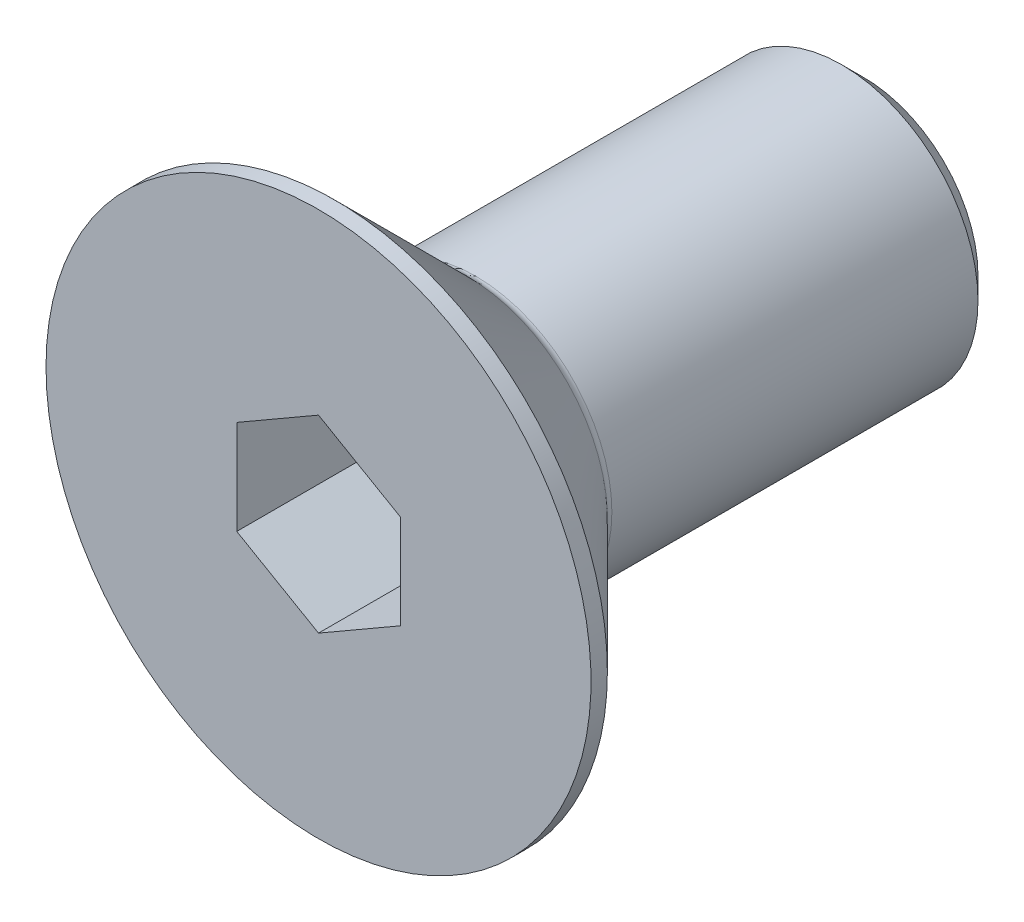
ISO-10303-21;
HEADER;
FILE_DESCRIPTION(('STEP AP214'),'2;1');
FILE_NAME('part.step','',(''),(''),'','','');
FILE_SCHEMA(('AUTOMOTIVE_DESIGN { 1 0 10303 214 1 1 1 1 }'));
ENDSEC;
DATA;
#1=APPLICATION_CONTEXT('core data for automotive mechanical design processes');
#2=APPLICATION_PROTOCOL_DEFINITION('international standard','automotive_design',2000,#1);
#3=PRODUCT_CONTEXT('',#1,'mechanical');
#4=PRODUCT('Part','Part','',(#3));
#5=PRODUCT_RELATED_PRODUCT_CATEGORY('part','',(#4));
#6=PRODUCT_DEFINITION_FORMATION('','',#4);
#7=PRODUCT_DEFINITION_CONTEXT('part definition',#1,'design');
#8=PRODUCT_DEFINITION('design','',#6,#7);
#9=PRODUCT_DEFINITION_SHAPE('','',#8);
#10=(LENGTH_UNIT() NAMED_UNIT(*) SI_UNIT(.MILLI.,.METRE.));
#11=(NAMED_UNIT(*) PLANE_ANGLE_UNIT() SI_UNIT($,.RADIAN.));
#12=(NAMED_UNIT(*) SI_UNIT($,.STERADIAN.) SOLID_ANGLE_UNIT());
#13=UNCERTAINTY_MEASURE_WITH_UNIT(LENGTH_MEASURE(1.E-05),#10,'distance_accuracy_value','');
#14=(GEOMETRIC_REPRESENTATION_CONTEXT(3) GLOBAL_UNCERTAINTY_ASSIGNED_CONTEXT((#13)) GLOBAL_UNIT_ASSIGNED_CONTEXT((#10,
#11,#12)) REPRESENTATION_CONTEXT('',''));
#15=CARTESIAN_POINT('',(0.,0.,0.));
#16=DIRECTION('',(0.,0.,1.));
#17=DIRECTION('',(1.,0.,0.));
#18=AXIS2_PLACEMENT_3D('',#15,#16,#17);
#19=CARTESIAN_POINT('',(0.,1.73205080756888,0.));
#20=DIRECTION('',(-0.5,0.866025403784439,0.));
#21=DIRECTION('',(-0.866025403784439,-0.5,0.));
#22=AXIS2_PLACEMENT_3D('',#19,#20,#21);
#23=PLANE('',#22);
#24=DIRECTION('',(0.,0.,1.));
#25=VECTOR('',#24,1.);
#26=CARTESIAN_POINT('',(0.,1.73205080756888,0.));
#27=LINE('',#26,#25);
#28=CARTESIAN_POINT('',(0.,1.73205080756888,-2.3));
#29=VERTEX_POINT('',#28);
#30=CARTESIAN_POINT('',(0.,1.73205080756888,0.));
#31=VERTEX_POINT('',#30);
#32=EDGE_CURVE('E82',#29,#31,#27,.T.);
#33=ORIENTED_EDGE('',*,*,#32,.T.);
#34=DIRECTION('',(-0.866025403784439,-0.5,0.));
#35=VECTOR('',#34,1.);
#36=CARTESIAN_POINT('',(0.,1.73205080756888,0.));
#37=LINE('',#36,#35);
#38=CARTESIAN_POINT('',(-1.5,0.866025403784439,0.));
#39=VERTEX_POINT('',#38);
#40=EDGE_CURVE('E71',#39,#31,#37,.F.);
#41=ORIENTED_EDGE('',*,*,#40,.F.);
#42=DIRECTION('',(0.,0.,1.));
#43=VECTOR('',#42,1.);
#44=CARTESIAN_POINT('',(-1.5,0.866025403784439,0.));
#45=LINE('',#44,#43);
#46=CARTESIAN_POINT('',(-1.5,0.866025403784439,-2.3));
#47=VERTEX_POINT('',#46);
#48=EDGE_CURVE('E138',#39,#47,#45,.F.);
#49=ORIENTED_EDGE('',*,*,#48,.T.);
#50=DIRECTION('',(-0.866025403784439,-0.5,0.));
#51=VECTOR('',#50,1.);
#52=CARTESIAN_POINT('',(0.,1.73205080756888,-2.3));
#53=LINE('',#52,#51);
#54=EDGE_CURVE('E67',#29,#47,#53,.T.);
#55=ORIENTED_EDGE('',*,*,#54,.F.);
#56=EDGE_LOOP('',(#33,#41,#49,#55));
#57=FACE_BOUND('',#56,.T.);
#58=ADVANCED_FACE('F16',(#57),#23,.F.);
#59=CARTESIAN_POINT('',(1.5,0.86602540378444,0.));
#60=DIRECTION('',(0.499999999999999,0.866025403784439,0.));
#61=DIRECTION('',(-0.866025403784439,0.499999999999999,0.));
#62=AXIS2_PLACEMENT_3D('',#59,#60,#61);
#63=PLANE('',#62);
#64=DIRECTION('',(0.,0.,-1.));
#65=VECTOR('',#64,1.);
#66=CARTESIAN_POINT('',(1.5,0.86602540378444,0.));
#67=LINE('',#66,#65);
#68=CARTESIAN_POINT('',(1.5,0.86602540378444,-2.3));
#69=VERTEX_POINT('',#68);
#70=CARTESIAN_POINT('',(1.5,0.86602540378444,0.));
#71=VERTEX_POINT('',#70);
#72=EDGE_CURVE('E87',#69,#71,#67,.F.);
#73=ORIENTED_EDGE('',*,*,#72,.T.);
#74=DIRECTION('',(-0.866025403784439,0.499999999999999,0.));
#75=VECTOR('',#74,1.);
#76=CARTESIAN_POINT('',(1.5,0.86602540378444,0.));
#77=LINE('',#76,#75);
#78=EDGE_CURVE('E75',#31,#71,#77,.F.);
#79=ORIENTED_EDGE('',*,*,#78,.F.);
#80=ORIENTED_EDGE('',*,*,#32,.F.);
#81=DIRECTION('',(-0.866025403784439,0.499999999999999,0.));
#82=VECTOR('',#81,1.);
#83=CARTESIAN_POINT('',(1.5,0.86602540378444,-2.3));
#84=LINE('',#83,#82);
#85=EDGE_CURVE('E88',#69,#29,#84,.T.);
#86=ORIENTED_EDGE('',*,*,#85,.F.);
#87=EDGE_LOOP('',(#73,#79,#80,#86));
#88=FACE_BOUND('',#87,.T.);
#89=ADVANCED_FACE('F85',(#88),#63,.F.);
#90=CARTESIAN_POINT('',(-1.5,0.866025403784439,0.));
#91=DIRECTION('',(-1.,0.,0.));
#92=DIRECTION('',(0.,0.,1.));
#93=AXIS2_PLACEMENT_3D('',#90,#91,#92);
#94=PLANE('',#93);
#95=ORIENTED_EDGE('',*,*,#48,.F.);
#96=DIRECTION('',(0.,1.,0.));
#97=VECTOR('',#96,1.);
#98=CARTESIAN_POINT('',(-1.5,0.866025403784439,0.));
#99=LINE('',#98,#97);
#100=CARTESIAN_POINT('',(-1.5,-0.866025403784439,0.));
#101=VERTEX_POINT('',#100);
#102=EDGE_CURVE('E78',#101,#39,#99,.T.);
#103=ORIENTED_EDGE('',*,*,#102,.F.);
#104=DIRECTION('',(0.,0.,1.));
#105=VECTOR('',#104,1.);
#106=CARTESIAN_POINT('',(-1.5,-0.866025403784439,0.));
#107=LINE('',#106,#105);
#108=CARTESIAN_POINT('',(-1.5,-0.866025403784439,-2.3));
#109=VERTEX_POINT('',#108);
#110=EDGE_CURVE('E129',#101,#109,#107,.F.);
#111=ORIENTED_EDGE('',*,*,#110,.T.);
#112=DIRECTION('',(0.,1.,0.));
#113=VECTOR('',#112,1.);
#114=CARTESIAN_POINT('',(-1.5,0.866025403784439,-2.3));
#115=LINE('',#114,#113);
#116=EDGE_CURVE('E136',#47,#109,#115,.F.);
#117=ORIENTED_EDGE('',*,*,#116,.F.);
#118=EDGE_LOOP('',(#95,#103,#111,#117));
#119=FACE_BOUND('',#118,.T.);
#120=ADVANCED_FACE('F141',(#119),#94,.F.);
#121=CARTESIAN_POINT('',(1.5,-0.866025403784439,0.));
#122=DIRECTION('',(1.,0.,0.));
#123=DIRECTION('',(0.,0.,-1.));
#124=AXIS2_PLACEMENT_3D('',#121,#122,#123);
#125=PLANE('',#124);
#126=DIRECTION('',(0.,0.,1.));
#127=VECTOR('',#126,1.);
#128=CARTESIAN_POINT('',(1.5,-0.866025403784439,0.));
#129=LINE('',#128,#127);
#130=CARTESIAN_POINT('',(1.5,-0.866025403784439,-2.3));
#131=VERTEX_POINT('',#130);
#132=CARTESIAN_POINT('',(1.5,-0.866025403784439,0.));
#133=VERTEX_POINT('',#132);
#134=EDGE_CURVE('E121',#131,#133,#129,.T.);
#135=ORIENTED_EDGE('',*,*,#134,.T.);
#136=DIRECTION('',(0.,1.,0.));
#137=VECTOR('',#136,1.);
#138=CARTESIAN_POINT('',(1.5,-0.866025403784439,0.));
#139=LINE('',#138,#137);
#140=EDGE_CURVE('E35',#71,#133,#139,.F.);
#141=ORIENTED_EDGE('',*,*,#140,.F.);
#142=ORIENTED_EDGE('',*,*,#72,.F.);
#143=DIRECTION('',(0.,1.,0.));
#144=VECTOR('',#143,1.);
#145=CARTESIAN_POINT('',(1.5,0.,-2.3));
#146=LINE('',#145,#144);
#147=EDGE_CURVE('E123',#131,#69,#146,.T.);
#148=ORIENTED_EDGE('',*,*,#147,.F.);
#149=EDGE_LOOP('',(#135,#141,#142,#148));
#150=FACE_BOUND('',#149,.T.);
#151=ADVANCED_FACE('F148',(#150),#125,.F.);
#152=CARTESIAN_POINT('',(-1.5,-0.866025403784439,0.));
#153=DIRECTION('',(-0.499999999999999,-0.866025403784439,0.));
#154=DIRECTION('',(0.866025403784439,-0.499999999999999,0.));
#155=AXIS2_PLACEMENT_3D('',#152,#153,#154);
#156=PLANE('',#155);
#157=ORIENTED_EDGE('',*,*,#110,.F.);
#158=DIRECTION('',(0.866025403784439,-0.499999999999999,0.));
#159=VECTOR('',#158,1.);
#160=CARTESIAN_POINT('',(-1.5,-0.866025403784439,0.));
#161=LINE('',#160,#159);
#162=CARTESIAN_POINT('',(0.,-1.73205080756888,0.));
#163=VERTEX_POINT('',#162);
#164=EDGE_CURVE('E132',#163,#101,#161,.F.);
#165=ORIENTED_EDGE('',*,*,#164,.F.);
#166=DIRECTION('',(0.,0.,1.));
#167=VECTOR('',#166,1.);
#168=CARTESIAN_POINT('',(0.,-1.73205080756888,0.));
#169=LINE('',#168,#167);
#170=CARTESIAN_POINT('',(0.,-1.73205080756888,-2.3));
#171=VERTEX_POINT('',#170);
#172=EDGE_CURVE('E119',#163,#171,#169,.F.);
#173=ORIENTED_EDGE('',*,*,#172,.T.);
#174=DIRECTION('',(0.866025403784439,-0.5,0.));
#175=VECTOR('',#174,1.);
#176=CARTESIAN_POINT('',(-1.5,-0.866025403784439,-2.3));
#177=LINE('',#176,#175);
#178=EDGE_CURVE('E126',#109,#171,#177,.T.);
#179=ORIENTED_EDGE('',*,*,#178,.F.);
#180=EDGE_LOOP('',(#157,#165,#173,#179));
#181=FACE_BOUND('',#180,.T.);
#182=ADVANCED_FACE('F155',(#181),#156,.F.);
#183=CARTESIAN_POINT('',(0.,0.,-2.3));
#184=DIRECTION('',(0.,0.,1.));
#185=DIRECTION('',(1.,0.,0.));
#186=AXIS2_PLACEMENT_3D('',#183,#184,#185);
#187=PLANE('',#186);
#188=ORIENTED_EDGE('',*,*,#54,.T.);
#189=ORIENTED_EDGE('',*,*,#116,.T.);
#190=ORIENTED_EDGE('',*,*,#178,.T.);
#191=DIRECTION('',(0.866025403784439,0.5,0.));
#192=VECTOR('',#191,1.);
#193=CARTESIAN_POINT('',(0.,-1.73205080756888,-2.3));
#194=LINE('',#193,#192);
#195=EDGE_CURVE('E116',#171,#131,#194,.T.);
#196=ORIENTED_EDGE('',*,*,#195,.T.);
#197=ORIENTED_EDGE('',*,*,#147,.T.);
#198=ORIENTED_EDGE('',*,*,#85,.T.);
#199=EDGE_LOOP('',(#188,#189,#190,#196,#197,#198));
#200=FACE_BOUND('',#199,.T.);
#201=ADVANCED_FACE('F145',(#200),#187,.T.);
#202=CARTESIAN_POINT('',(0.,-1.73205080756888,0.));
#203=DIRECTION('',(0.5,-0.866025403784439,0.));
#204=DIRECTION('',(0.866025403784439,0.5,0.));
#205=AXIS2_PLACEMENT_3D('',#202,#203,#204);
#206=PLANE('',#205);
#207=ORIENTED_EDGE('',*,*,#172,.F.);
#208=DIRECTION('',(-0.866025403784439,-0.5,0.));
#209=VECTOR('',#208,1.);
#210=CARTESIAN_POINT('',(1.5,-0.866025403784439,0.));
#211=LINE('',#210,#209);
#212=EDGE_CURVE('E114',#133,#163,#211,.T.);
#213=ORIENTED_EDGE('',*,*,#212,.F.);
#214=ORIENTED_EDGE('',*,*,#134,.F.);
#215=ORIENTED_EDGE('',*,*,#195,.F.);
#216=EDGE_LOOP('',(#207,#213,#214,#215));
#217=FACE_BOUND('',#216,.T.);
#218=ADVANCED_FACE('F153',(#217),#206,.F.);
#219=CARTESIAN_POINT('',(2.5,0.,0.));
#220=DIRECTION('',(0.,0.,1.));
#221=DIRECTION('',(1.,0.,0.));
#222=AXIS2_PLACEMENT_3D('',#219,#220,#221);
#223=PLANE('',#222);
#224=ORIENTED_EDGE('',*,*,#140,.T.);
#225=ORIENTED_EDGE('',*,*,#212,.T.);
#226=ORIENTED_EDGE('',*,*,#164,.T.);
#227=ORIENTED_EDGE('',*,*,#102,.T.);
#228=ORIENTED_EDGE('',*,*,#40,.T.);
#229=ORIENTED_EDGE('',*,*,#78,.T.);
#230=EDGE_LOOP('',(#224,#225,#226,#227,#228,#229));
#231=FACE_BOUND('',#230,.T.);
#232=CARTESIAN_POINT('',(0.,0.,0.));
#233=DIRECTION('',(0.,0.,-1.));
#234=DIRECTION('',(-1.,0.,0.));
#235=AXIS2_PLACEMENT_3D('',#232,#233,#234);
#236=CIRCLE('',#235,5.);
#237=CARTESIAN_POINT('',(-5.,0.,0.));
#238=VERTEX_POINT('',#237);
#239=EDGE_CURVE('E20',#238,#238,#236,.T.);
#240=ORIENTED_EDGE('',*,*,#239,.F.);
#241=EDGE_LOOP('',(#240));
#242=FACE_BOUND('',#241,.T.);
#243=ADVANCED_FACE('F72',(#231,#242),#223,.T.);
#244=CARTESIAN_POINT('',(0.,0.,-0.15));
#245=DIRECTION('',(0.,0.,-1.));
#246=DIRECTION('',(-1.,0.,0.));
#247=AXIS2_PLACEMENT_3D('',#244,#245,#246);
#248=CYLINDRICAL_SURFACE('',#247,5.);
#249=ORIENTED_EDGE('',*,*,#239,.T.);
#250=EDGE_LOOP('',(#249));
#251=FACE_BOUND('',#250,.T.);
#252=CARTESIAN_POINT('',(0.,0.,-0.299999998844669));
#253=DIRECTION('',(0.,0.,1.));
#254=DIRECTION('',(1.,0.,0.));
#255=AXIS2_PLACEMENT_3D('',#252,#253,#254);
#256=CIRCLE('',#255,4.99999999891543);
#257=CARTESIAN_POINT('',(4.99999999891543,0.,-0.299999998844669));
#258=VERTEX_POINT('',#257);
#259=EDGE_CURVE('E101',#258,#258,#256,.F.);
#260=ORIENTED_EDGE('',*,*,#259,.F.);
#261=EDGE_LOOP('',(#260));
#262=FACE_BOUND('',#261,.T.);
#263=ADVANCED_FACE('F183',(#251,#262),#248,.T.);
#264=CARTESIAN_POINT('',(0.,0.,-0.299999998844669));
#265=DIRECTION('',(0.,0.,1.));
#266=DIRECTION('',(1.,0.,0.));
#267=AXIS2_PLACEMENT_3D('',#264,#265,#266);
#268=CONICAL_SURFACE('',#267,4.99999999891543,0.785398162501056);
#269=CARTESIAN_POINT('',(0.,0.,-2.74142135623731));
#270=DIRECTION('',(0.,0.,-1.));
#271=DIRECTION('',(-1.,0.,0.));
#272=AXIS2_PLACEMENT_3D('',#269,#270,#271);
#273=CIRCLE('',#272,2.55857864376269);
#274=CARTESIAN_POINT('',(-2.55857864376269,0.,-2.74142135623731));
#275=VERTEX_POINT('',#274);
#276=EDGE_CURVE('E95',#275,#275,#273,.T.);
#277=ORIENTED_EDGE('',*,*,#276,.F.);
#278=EDGE_LOOP('',(#277));
#279=FACE_BOUND('',#278,.T.);
#280=ORIENTED_EDGE('',*,*,#259,.T.);
#281=EDGE_LOOP('',(#280));
#282=FACE_BOUND('',#281,.T.);
#283=ADVANCED_FACE('F179',(#279,#282),#268,.T.);
#284=CARTESIAN_POINT('',(1.25,0.,-10.));
#285=DIRECTION('',(0.,0.,-1.));
#286=DIRECTION('',(-1.,0.,0.));
#287=AXIS2_PLACEMENT_3D('',#284,#285,#286);
#288=PLANE('',#287);
#289=CARTESIAN_POINT('',(0.,0.,-10.0000000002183));
#290=DIRECTION('',(0.,0.,1.));
#291=DIRECTION('',(1.,0.,0.));
#292=AXIS2_PLACEMENT_3D('',#289,#290,#291);
#293=CIRCLE('',#292,2.10000000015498);
#294=CARTESIAN_POINT('',(2.10000000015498,0.,-10.0000000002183));
#295=VERTEX_POINT('',#294);
#296=EDGE_CURVE('E93',#295,#295,#293,.T.);
#297=ORIENTED_EDGE('',*,*,#296,.F.);
#298=EDGE_LOOP('',(#297));
#299=FACE_BOUND('',#298,.T.);
#300=ADVANCED_FACE('F176',(#299),#288,.T.);
#301=CARTESIAN_POINT('',(0.,0.,-2.88284271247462));
#302=DIRECTION('',(0.,0.,-1.));
#303=DIRECTION('',(-1.,0.,0.));
#304=AXIS2_PLACEMENT_3D('',#301,#302,#303);
#305=TOROIDAL_SURFACE('',#304,2.7,0.200000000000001);
#306=CARTESIAN_POINT('',(0.,0.,-2.88284271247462));
#307=DIRECTION('',(0.,0.,-1.));
#308=DIRECTION('',(-1.,0.,0.));
#309=AXIS2_PLACEMENT_3D('',#306,#307,#308);
#310=CIRCLE('',#309,2.5);
#311=CARTESIAN_POINT('',(-2.5,0.,-2.88284271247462));
#312=VERTEX_POINT('',#311);
#313=EDGE_CURVE('E26',#312,#312,#310,.T.);
#314=ORIENTED_EDGE('',*,*,#313,.F.);
#315=EDGE_LOOP('',(#314));
#316=FACE_BOUND('',#315,.T.);
#317=ORIENTED_EDGE('',*,*,#276,.T.);
#318=EDGE_LOOP('',(#317));
#319=FACE_BOUND('',#318,.T.);
#320=ADVANCED_FACE('F18',(#316,#319),#305,.F.);
#321=CARTESIAN_POINT('',(0.,0.,-9.59999999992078));
#322=DIRECTION('',(0.,0.,1.));
#323=DIRECTION('',(1.,0.,0.));
#324=AXIS2_PLACEMENT_3D('',#321,#322,#323);
#325=CONICAL_SURFACE('',#324,2.49999999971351,0.785398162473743);
#326=ORIENTED_EDGE('',*,*,#296,.T.);
#327=EDGE_LOOP('',(#326));
#328=FACE_BOUND('',#327,.T.);
#329=CARTESIAN_POINT('',(0.,0.,-9.6));
#330=DIRECTION('',(0.,0.,-1.));
#331=DIRECTION('',(-1.,0.,0.));
#332=AXIS2_PLACEMENT_3D('',#329,#330,#331);
#333=CIRCLE('',#332,2.5);
#334=CARTESIAN_POINT('',(-2.5,0.,-9.6));
#335=VERTEX_POINT('',#334);
#336=EDGE_CURVE('E11',#335,#335,#333,.F.);
#337=ORIENTED_EDGE('',*,*,#336,.F.);
#338=EDGE_LOOP('',(#337));
#339=FACE_BOUND('',#338,.T.);
#340=ADVANCED_FACE('F167',(#328,#339),#325,.T.);
#341=CARTESIAN_POINT('',(0.,0.,-6.4));
#342=DIRECTION('',(0.,0.,-1.));
#343=DIRECTION('',(-1.,0.,0.));
#344=AXIS2_PLACEMENT_3D('',#341,#342,#343);
#345=CYLINDRICAL_SURFACE('',#344,2.5);
#346=ORIENTED_EDGE('',*,*,#336,.T.);
#347=EDGE_LOOP('',(#346));
#348=FACE_BOUND('',#347,.T.);
#349=ORIENTED_EDGE('',*,*,#313,.T.);
#350=EDGE_LOOP('',(#349));
#351=FACE_BOUND('',#350,.T.);
#352=ADVANCED_FACE('F165',(#348,#351),#345,.T.);
#353=CLOSED_SHELL('',(#58,#89,#120,#151,#182,#201,#218,#243,#263,#283,#300,#320,#340,#352));
#354=MANIFOLD_SOLID_BREP('B1',#353);
#355=ADVANCED_BREP_SHAPE_REPRESENTATION('',(#18,#354),#14);
#356=SHAPE_DEFINITION_REPRESENTATION(#9,#355);
ENDSEC;
END-ISO-10303-21;
